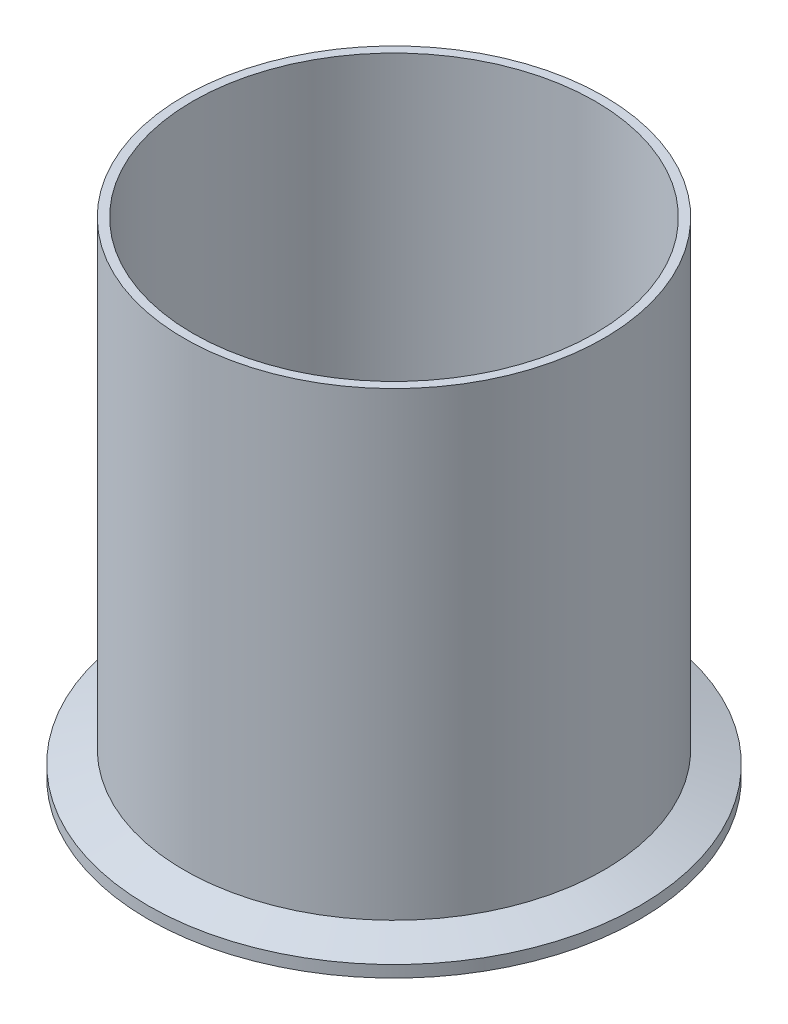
from build123d import *


with BuildPart() as part:
    # Sketch1 → Revolve2 (revolve)
    with BuildSketch(Plane.XY, mode=Mode.PRIVATE) as revolve2_sk:
        with BuildLine():
            Line((-48.6918, 0), (-48.6918, 117.475))
            Line((-48.6918, 117.475), (-50.8, 117.475))
            Line((-50.8, 117.475), (-50.8, 5.997291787))
            Line((-50.8, 5.997291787), (-59.4614, 2.8448))
            Line((-59.4614, 2.8448), (-59.4614, 0))
            Line((-59.4614, 0), (-56.618508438, 0))
            ThreePointArc((-56.618508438, 0), (-56.186311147, 0.129217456), (-55.895966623, 0.474458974))
            ThreePointArc((-55.895966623, 0.474458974), (-54.8005, 1.1938), (-53.705033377, 0.474458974))
            ThreePointArc((-53.705033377, 0.474458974), (-53.414688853, 0.129217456), (-52.982491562, 0))
            Line((-52.982491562, 0), (-48.6918, 0))
        make_face()
    revolve(revolve2_sk.sketch.rotate(Axis((0, 0, 0), (0, 1, 0)), 270), axis=Axis((0, 0, 0), (0, 1, 0)))


solid = part.part
